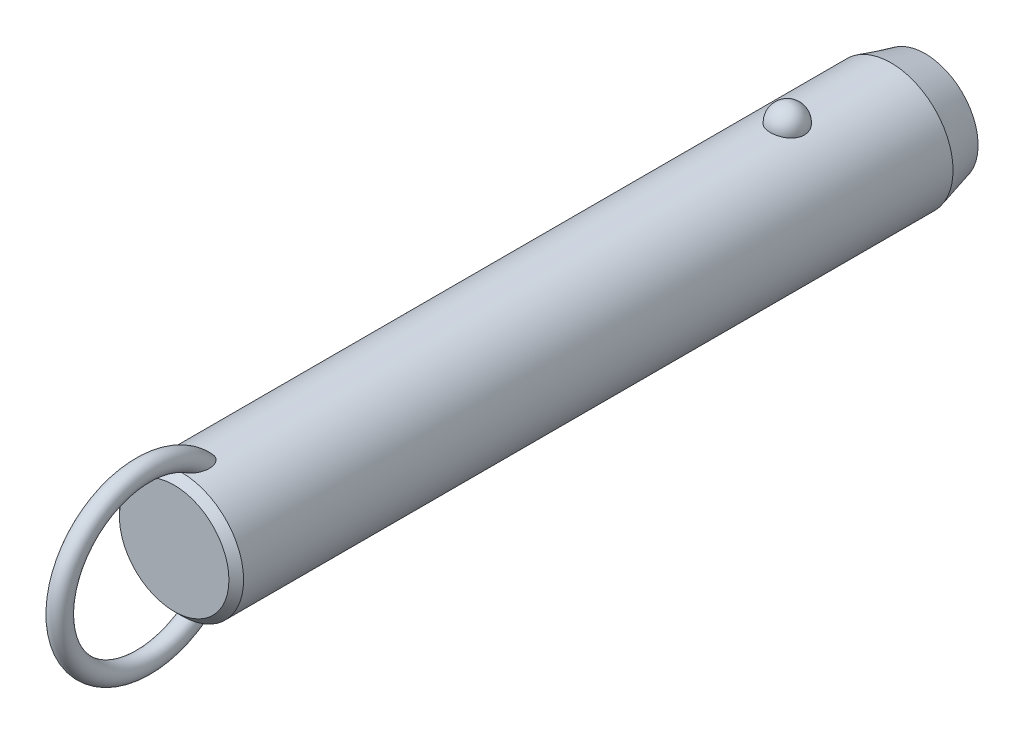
ISO-10303-21;
HEADER;
FILE_DESCRIPTION(('STEP AP214'),'2;1');
FILE_NAME('part.step','',(''),(''),'','','');
FILE_SCHEMA(('AUTOMOTIVE_DESIGN { 1 0 10303 214 1 1 1 1 }'));
ENDSEC;
DATA;
#1=APPLICATION_CONTEXT('core data for automotive mechanical design processes');
#2=APPLICATION_PROTOCOL_DEFINITION('international standard','automotive_design',2000,#1);
#3=PRODUCT_CONTEXT('',#1,'mechanical');
#4=PRODUCT('Part','Part','',(#3));
#5=PRODUCT_RELATED_PRODUCT_CATEGORY('part','',(#4));
#6=PRODUCT_DEFINITION_FORMATION('','',#4);
#7=PRODUCT_DEFINITION_CONTEXT('part definition',#1,'design');
#8=PRODUCT_DEFINITION('design','',#6,#7);
#9=PRODUCT_DEFINITION_SHAPE('','',#8);
#10=(LENGTH_UNIT() NAMED_UNIT(*) SI_UNIT(.MILLI.,.METRE.));
#11=(NAMED_UNIT(*) PLANE_ANGLE_UNIT() SI_UNIT($,.RADIAN.));
#12=(NAMED_UNIT(*) SI_UNIT($,.STERADIAN.) SOLID_ANGLE_UNIT());
#13=UNCERTAINTY_MEASURE_WITH_UNIT(LENGTH_MEASURE(1.E-05),#10,'distance_accuracy_value','');
#14=(GEOMETRIC_REPRESENTATION_CONTEXT(3) GLOBAL_UNCERTAINTY_ASSIGNED_CONTEXT((#13)) GLOBAL_UNIT_ASSIGNED_CONTEXT((#10,
#11,#12)) REPRESENTATION_CONTEXT('',''));
#15=CARTESIAN_POINT('',(0.,0.,0.));
#16=DIRECTION('',(0.,0.,1.));
#17=DIRECTION('',(1.,0.,0.));
#18=AXIS2_PLACEMENT_3D('',#15,#16,#17);
#19=CARTESIAN_POINT('',(0.,0.,109.2));
#20=DIRECTION('',(0.,0.,-1.));
#21=DIRECTION('',(-1.,0.,0.));
#22=AXIS2_PLACEMENT_3D('',#19,#20,#21);
#23=CYLINDRICAL_SURFACE('',#22,12.7);
#24=CARTESIAN_POINT('',(3.46661256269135,12.2177165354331,-3.5));
#25=CARTESIAN_POINT('',(3.4666090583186,12.2177194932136,-3.30432790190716));
#26=CARTESIAN_POINT('',(3.45063567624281,12.2222841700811,-3.10861112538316));
#27=CARTESIAN_POINT('',(3.38712451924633,12.2400345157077,-2.72271899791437));
#28=CARTESIAN_POINT('',(3.33957415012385,12.2532236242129,-2.53254588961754));
#29=CARTESIAN_POINT('',(3.2141234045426,12.286724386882,-2.16324948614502));
#30=CARTESIAN_POINT('',(3.13623639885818,12.3070329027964,-1.98412136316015));
#31=CARTESIAN_POINT('',(2.95205930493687,12.3525018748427,-1.64180592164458));
#32=CARTESIAN_POINT('',(2.84577003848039,12.3776621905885,-1.47861814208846));
#33=CARTESIAN_POINT('',(2.60688050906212,12.4301712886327,-1.17190583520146));
#34=CARTESIAN_POINT('',(2.47415697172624,12.4575299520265,-1.02847897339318));
#35=CARTESIAN_POINT('',(2.18615174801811,12.5112810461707,-0.766177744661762));
#36=CARTESIAN_POINT('',(2.03087002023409,12.5376734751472,-0.64730342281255));
#37=CARTESIAN_POINT('',(1.70237334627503,12.5864761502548,-0.437732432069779));
#38=CARTESIAN_POINT('',(1.52920948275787,12.6088972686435,-0.346958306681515));
#39=CARTESIAN_POINT('',(1.16944170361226,12.6473352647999,-0.195750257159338));
#40=CARTESIAN_POINT('',(0.982839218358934,12.663352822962,-0.135313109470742));
#41=CARTESIAN_POINT('',(0.604961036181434,12.6869706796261,-0.0473241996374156));
#42=CARTESIAN_POINT('',(0.41382314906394,12.6947125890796,-0.0192185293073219));
#43=CARTESIAN_POINT('',(0.0293827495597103,12.7014203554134,0.0051725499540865));
#44=CARTESIAN_POINT('',(-0.163919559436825,12.7003870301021,0.00146092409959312));
#45=CARTESIAN_POINT('',(-0.544374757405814,12.689735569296,-0.0373939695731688));
#46=CARTESIAN_POINT('',(-0.731575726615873,12.6802364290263,-0.0721015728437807));
#47=CARTESIAN_POINT('',(-1.09733277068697,12.6538333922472,-0.171364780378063));
#48=CARTESIAN_POINT('',(-1.27588869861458,12.6369293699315,-0.235920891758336));
#49=CARTESIAN_POINT('',(-1.6204698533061,12.5973946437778,-0.393548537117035));
#50=CARTESIAN_POINT('',(-1.78641865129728,12.5747321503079,-0.486778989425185));
#51=CARTESIAN_POINT('',(-2.10030671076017,12.5261316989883,-0.699110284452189));
#52=CARTESIAN_POINT('',(-2.24824419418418,12.5001934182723,-0.818213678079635));
#53=CARTESIAN_POINT('',(-2.52491489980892,12.4472906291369,-1.08157124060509));
#54=CARTESIAN_POINT('',(-2.65324222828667,12.4203160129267,-1.22624992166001));
#55=CARTESIAN_POINT('',(-2.88410007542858,12.3687509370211,-1.53528325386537));
#56=CARTESIAN_POINT('',(-2.98662883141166,12.3441606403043,-1.69963924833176));
#57=CARTESIAN_POINT('',(-3.16432417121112,12.2998199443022,-2.04548497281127));
#58=CARTESIAN_POINT('',(-3.23917525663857,12.2801261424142,-2.22714424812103));
#59=CARTESIAN_POINT('',(-3.35800573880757,12.248167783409,-2.6009138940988));
#60=CARTESIAN_POINT('',(-3.4019860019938,12.2359030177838,-2.79302397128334));
#61=CARTESIAN_POINT('',(-3.45784812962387,12.2202347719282,-3.18140279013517));
#62=CARTESIAN_POINT('',(-3.46986123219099,12.2167950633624,-3.37765118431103));
#63=CARTESIAN_POINT('',(-3.46186273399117,12.2190638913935,-3.76943689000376));
#64=CARTESIAN_POINT('',(-3.44185196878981,12.2247721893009,-3.96497421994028));
#65=CARTESIAN_POINT('',(-3.37048652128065,12.2446381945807,-4.34881728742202));
#66=CARTESIAN_POINT('',(-3.31928253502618,12.2587552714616,-4.53715319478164));
#67=CARTESIAN_POINT('',(-3.18693461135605,12.2938237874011,-4.90231727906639));
#68=CARTESIAN_POINT('',(-3.1057895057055,12.3147754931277,-5.07914500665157));
#69=CARTESIAN_POINT('',(-2.91506431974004,12.3613125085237,-5.41732059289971));
#70=CARTESIAN_POINT('',(-2.80533587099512,12.3869217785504,-5.57858147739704));
#71=CARTESIAN_POINT('',(-2.560414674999,12.4398525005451,-5.88013283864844));
#72=CARTESIAN_POINT('',(-2.42522099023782,12.4671740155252,-6.02042254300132));
#73=CARTESIAN_POINT('',(-2.1323357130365,12.5205965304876,-6.27662798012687));
#74=CARTESIAN_POINT('',(-1.97456596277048,12.5466928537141,-6.3924554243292));
#75=CARTESIAN_POINT('',(-1.64115839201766,12.5946384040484,-6.59583547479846));
#76=CARTESIAN_POINT('',(-1.46552179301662,12.6164879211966,-6.68339001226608));
#77=CARTESIAN_POINT('',(-1.10356050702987,12.6532533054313,-6.82682153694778));
#78=CARTESIAN_POINT('',(-0.9173913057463,12.6682500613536,-6.8830698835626));
#79=CARTESIAN_POINT('',(-0.537836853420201,12.6900288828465,-6.96386887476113));
#80=CARTESIAN_POINT('',(-0.344452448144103,12.6968119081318,-6.9884232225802));
#81=CARTESIAN_POINT('',(0.0402577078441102,12.7013667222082,-7.00496469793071));
#82=CARTESIAN_POINT('',(0.231556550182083,12.6993008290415,-6.99753844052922));
#83=CARTESIAN_POINT('',(0.610105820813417,12.6867505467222,-6.9516636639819));
#84=CARTESIAN_POINT('',(0.797356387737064,12.6762664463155,-6.913216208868));
#85=CARTESIAN_POINT('',(1.16186657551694,12.6480587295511,-6.80658431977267));
#86=CARTESIAN_POINT('',(1.33915951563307,12.6303611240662,-6.73850666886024));
#87=CARTESIAN_POINT('',(1.67968518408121,12.5896027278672,-6.5745087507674));
#88=CARTESIAN_POINT('',(1.84291705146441,12.5665416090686,-6.47858678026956));
#89=CARTESIAN_POINT('',(2.15340192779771,12.5171072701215,-6.25982455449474));
#90=CARTESIAN_POINT('',(2.30037831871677,12.4906895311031,-6.13660186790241));
#91=CARTESIAN_POINT('',(2.5717412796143,12.4376567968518,-5.86739587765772));
#92=CARTESIAN_POINT('',(2.69612388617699,12.4110417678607,-5.72140858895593));
#93=CARTESIAN_POINT('',(2.92107785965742,12.360051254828,-5.40794137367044));
#94=CARTESIAN_POINT('',(3.02121329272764,12.3357209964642,-5.24014110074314));
#95=CARTESIAN_POINT('',(3.19236291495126,12.2925446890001,-4.88969865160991));
#96=CARTESIAN_POINT('',(3.26338839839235,12.2736965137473,-4.70706226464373));
#97=CARTESIAN_POINT('',(3.36788038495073,12.245404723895,-4.35469510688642));
#98=CARTESIAN_POINT('',(3.40484026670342,12.2351018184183,-4.18605935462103));
#99=CARTESIAN_POINT('',(3.45420764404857,12.2212564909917,-3.84496058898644));
#100=CARTESIAN_POINT('',(3.46661565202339,12.2177139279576,-3.67249765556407));
#101=CARTESIAN_POINT('',(3.46661256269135,12.2177165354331,-3.5));
#102=B_SPLINE_CURVE_WITH_KNOTS('',3,(#24,#25,#26,#27,#28,#29,#30,#31,#32,#33,#34,#35,#36,#37,
#38,#39,#40,#41,#42,#43,#44,#45,#46,#47,#48,#49,#50,#51,#52,#53,#54,#55,#56,#57,#58,#59,#60,#61,
#62,#63,#64,#65,#66,#67,#68,#69,#70,#71,#72,#73,#74,#75,#76,#77,#78,#79,#80,#81,#82,#83,#84,#85,
#86,#87,#88,#89,#90,#91,#92,#93,#94,#95,#96,#97,#98,#99,#100,#101),.UNSPECIFIED.,.T.,.F.,(4,2,2,
2,2,2,2,2,2,2,2,2,2,2,2,2,2,2,2,2,2,2,2,2,2,2,2,2,2,2,2,2,2,2,2,2,2,2,4),(0.,0.586396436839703,
1.17302689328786,1.7593990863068,2.34575431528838,2.93491084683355,3.52406845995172,
4.11158733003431,4.69904375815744,5.2762784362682,5.85345931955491,6.42265312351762,
6.99185659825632,7.56427334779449,8.136746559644,8.71981013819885,9.3029135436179,
9.89247258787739,10.4820150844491,11.0691335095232,11.6562366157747,12.2405256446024,
12.8248374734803,13.412244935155,13.9996740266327,14.5891883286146,15.1786623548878,
15.7609861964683,16.3432419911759,16.9148635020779,17.4864654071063,18.0560241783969,
18.6256177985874,19.2037609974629,19.7820055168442,20.3699810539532,20.957728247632,
21.4746855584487,21.9916320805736),.UNSPECIFIED.);
#103=CARTESIAN_POINT('',(3.46661256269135,12.2177165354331,-3.5));
#104=VERTEX_POINT('',#103);
#105=EDGE_CURVE('E41',#104,#104,#102,.T.);
#106=ORIENTED_EDGE('',*,*,#105,.T.);
#107=EDGE_LOOP('',(#106));
#108=FACE_BOUND('',#107,.T.);
#109=CARTESIAN_POINT('',(0.,0.,120.4));
#110=DIRECTION('',(0.,0.,1.));
#111=DIRECTION('',(1.,0.,0.));
#112=AXIS2_PLACEMENT_3D('',#109,#110,#111);
#113=CIRCLE('',#112,12.7);
#114=CARTESIAN_POINT('',(12.7,0.,120.4));
#115=VERTEX_POINT('',#114);
#116=EDGE_CURVE('E10',#115,#115,#113,.F.);
#117=ORIENTED_EDGE('',*,*,#116,.T.);
#118=EDGE_LOOP('',(#117));
#119=FACE_BOUND('',#118,.T.);
#120=CARTESIAN_POINT('',(-0.548122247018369,-12.6881662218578,114.143218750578));
#121=CARTESIAN_POINT('',(-0.648865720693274,-12.6838128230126,114.177926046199));
#122=CARTESIAN_POINT('',(-0.746398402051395,-12.6783867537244,114.222042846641));
#123=CARTESIAN_POINT('',(-0.932125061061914,-12.666091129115,114.326764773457));
#124=CARTESIAN_POINT('',(-1.02030388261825,-12.6592192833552,114.387396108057));
#125=CARTESIAN_POINT('',(-1.18487740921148,-12.6448747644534,114.521847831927));
#126=CARTESIAN_POINT('',(-1.26134296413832,-12.637406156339,114.595582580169));
#127=CARTESIAN_POINT('',(-1.40231200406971,-12.6225412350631,114.753604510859));
#128=CARTESIAN_POINT('',(-1.46681470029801,-12.6151449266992,114.83789238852));
#129=CARTESIAN_POINT('',(-1.60714786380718,-12.5981718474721,115.049657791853));
#130=CARTESIAN_POINT('',(-1.67725126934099,-12.588900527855,115.180962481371));
#131=CARTESIAN_POINT('',(-1.79536591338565,-12.5725964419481,115.453247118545));
#132=CARTESIAN_POINT('',(-1.84333535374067,-12.5655679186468,115.594244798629));
#133=CARTESIAN_POINT('',(-1.93422576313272,-12.5519624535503,115.937645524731));
#134=CARTESIAN_POINT('',(-1.96788773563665,-12.5466298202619,116.142557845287));
#135=CARTESIAN_POINT('',(-1.9941399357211,-12.542463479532,116.451760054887));
#136=CARTESIAN_POINT('',(-1.99883864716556,-12.5417153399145,116.555298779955));
#137=CARTESIAN_POINT('',(-2.00078003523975,-12.5414074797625,116.76245124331));
#138=CARTESIAN_POINT('',(-1.99802449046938,-12.5418474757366,116.866064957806));
#139=CARTESIAN_POINT('',(-1.98336733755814,-12.5441750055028,117.110320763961));
#140=CARTESIAN_POINT('',(-1.96851430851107,-12.5465291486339,117.250780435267));
#141=CARTESIAN_POINT('',(-1.92707089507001,-12.5529612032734,117.529960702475));
#142=CARTESIAN_POINT('',(-1.90047458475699,-12.5570399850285,117.668680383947));
#143=CARTESIAN_POINT('',(-1.8361912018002,-12.5666008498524,117.94341135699));
#144=CARTESIAN_POINT('',(-1.79850828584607,-12.57208240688,118.079423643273));
#145=CARTESIAN_POINT('',(-1.71223796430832,-12.5841228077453,118.347842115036));
#146=CARTESIAN_POINT('',(-1.66365679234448,-12.5906810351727,118.480250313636));
#147=CARTESIAN_POINT('',(-1.5780450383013,-12.6016176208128,118.68548877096));
#148=CARTESIAN_POINT('',(-1.54477252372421,-12.6057501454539,118.759914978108));
#149=CARTESIAN_POINT('',(-1.47424480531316,-12.6141930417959,118.906839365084));
#150=CARTESIAN_POINT('',(-1.43699041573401,-12.6185033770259,118.979337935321));
#151=CARTESIAN_POINT('',(-1.35825795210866,-12.6272207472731,119.121892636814));
#152=CARTESIAN_POINT('',(-1.31678520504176,-12.6316276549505,119.191951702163));
#153=CARTESIAN_POINT('',(-1.22917793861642,-12.6404532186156,119.329070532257));
#154=CARTESIAN_POINT('',(-1.18304514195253,-12.6448718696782,119.396131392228));
#155=CARTESIAN_POINT('',(-1.07246411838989,-12.6547893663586,119.543874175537));
#156=CARTESIAN_POINT('',(-1.00642239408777,-12.6602600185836,119.623384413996));
#157=CARTESIAN_POINT('',(-0.864441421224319,-12.6707460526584,119.773169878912));
#158=CARTESIAN_POINT('',(-0.788516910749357,-12.6757620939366,119.843458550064));
#159=CARTESIAN_POINT('',(-0.652215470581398,-12.6833591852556,119.948680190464));
#160=CARTESIAN_POINT('',(-0.59498203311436,-12.6861973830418,119.987624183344));
#161=CARTESIAN_POINT('',(-0.475269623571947,-12.6912445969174,120.056489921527));
#162=CARTESIAN_POINT('',(-0.412800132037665,-12.6934547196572,120.086427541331));
#163=CARTESIAN_POINT('',(-0.295749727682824,-12.6966636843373,120.129756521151));
#164=CARTESIAN_POINT('',(-0.241949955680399,-12.6978134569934,120.145218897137));
#165=CARTESIAN_POINT('',(-0.132508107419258,-12.6994261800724,120.166884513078));
#166=CARTESIAN_POINT('',(-0.0768679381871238,-12.6998898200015,120.173097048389));
#167=CARTESIAN_POINT('',(0.0347696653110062,-12.7000752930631,120.175583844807));
#168=CARTESIAN_POINT('',(0.0907676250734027,-12.6997954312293,120.171835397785));
#169=CARTESIAN_POINT('',(0.201283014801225,-12.6985255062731,120.154788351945));
#170=CARTESIAN_POINT('',(0.255799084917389,-12.6975348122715,120.141481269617));
#171=CARTESIAN_POINT('',(0.37604233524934,-12.6946091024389,120.10203792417));
#172=CARTESIAN_POINT('',(0.4409508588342,-12.6924943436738,120.073449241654));
#173=CARTESIAN_POINT('',(0.565350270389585,-12.6875639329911,120.006323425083));
#174=CARTESIAN_POINT('',(0.624828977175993,-12.6847467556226,119.967764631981));
#175=CARTESIAN_POINT('',(0.774116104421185,-12.6767252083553,119.856949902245));
#176=CARTESIAN_POINT('',(0.859449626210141,-12.6711344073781,119.778760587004));
#177=CARTESIAN_POINT('',(1.01789440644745,-12.6593922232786,119.610943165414));
#178=CARTESIAN_POINT('',(1.09096902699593,-12.653239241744,119.521282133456));
#179=CARTESIAN_POINT('',(1.22268793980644,-12.6411674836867,119.340265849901));
#180=CARTESIAN_POINT('',(1.28193986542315,-12.6352572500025,119.249345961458));
#181=CARTESIAN_POINT('',(1.39259777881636,-12.6235401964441,119.062792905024));
#182=CARTESIAN_POINT('',(1.44399707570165,-12.6177334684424,118.967155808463));
#183=CARTESIAN_POINT('',(1.53972870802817,-12.6064093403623,118.772273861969));
#184=CARTESIAN_POINT('',(1.58405262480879,-12.6008922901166,118.673024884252));
#185=CARTESIAN_POINT('',(1.66600705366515,-12.5903187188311,118.471772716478));
#186=CARTESIAN_POINT('',(1.70363651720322,-12.5852622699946,118.369769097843));
#187=CARTESIAN_POINT('',(1.7754537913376,-12.5753406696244,118.154358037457));
#188=CARTESIAN_POINT('',(1.80903453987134,-12.5705328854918,118.040745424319));
#189=CARTESIAN_POINT('',(1.86844163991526,-12.5618400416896,117.811457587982));
#190=CARTESIAN_POINT('',(1.89426665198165,-12.5579551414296,117.695782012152));
#191=CARTESIAN_POINT('',(1.93785464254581,-12.5513030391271,117.463007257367));
#192=CARTESIAN_POINT('',(1.95562640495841,-12.5485346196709,117.345909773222));
#193=CARTESIAN_POINT('',(1.98264463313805,-12.5442934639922,117.110747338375));
#194=CARTESIAN_POINT('',(1.99189298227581,-12.5428204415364,116.99268260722));
#195=CARTESIAN_POINT('',(2.00416068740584,-12.540871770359,116.680622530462));
#196=CARTESIAN_POINT('',(1.99944433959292,-12.541631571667,116.486229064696));
#197=CARTESIAN_POINT('',(1.9611375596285,-12.5476846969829,116.100309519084));
#198=CARTESIAN_POINT('',(1.92758341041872,-12.5529723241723,115.908780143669));
#199=CARTESIAN_POINT('',(1.83934342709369,-12.5661532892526,115.582272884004));
#200=CARTESIAN_POINT('',(1.79215440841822,-12.5730485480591,115.44524997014));
#201=CARTESIAN_POINT('',(1.67676242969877,-12.588958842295,115.180445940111));
#202=CARTESIAN_POINT('',(1.60859050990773,-12.597970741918,115.052651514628));
#203=CARTESIAN_POINT('',(1.4658383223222,-12.6152829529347,114.835800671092));
#204=CARTESIAN_POINT('',(1.39525727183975,-12.6233659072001,114.74410500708));
#205=CARTESIAN_POINT('',(1.23992594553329,-12.6395676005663,114.573485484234));
#206=CARTESIAN_POINT('',(1.15517932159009,-12.6476863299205,114.494558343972));
#207=CARTESIAN_POINT('',(0.971995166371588,-12.6630846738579,114.352643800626));
#208=CARTESIAN_POINT('',(0.873456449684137,-12.6703572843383,114.289784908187));
#209=CARTESIAN_POINT('',(0.665847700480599,-12.6829569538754,114.184487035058));
#210=CARTESIAN_POINT('',(0.556784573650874,-12.688285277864,114.142034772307));
#211=CARTESIAN_POINT('',(0.3473384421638,-12.6956226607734,114.084443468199));
#212=CARTESIAN_POINT('',(0.24775974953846,-12.6979816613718,114.066399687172));
#213=CARTESIAN_POINT('',(0.0470218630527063,-12.7003077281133,114.048600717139));
#214=CARTESIAN_POINT('',(-0.0541350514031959,-12.7002779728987,114.048821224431));
#215=CARTESIAN_POINT('',(-0.221414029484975,-12.6982482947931,114.064363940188));
#216=CARTESIAN_POINT('',(-0.288055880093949,-12.6969033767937,114.074666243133));
#217=CARTESIAN_POINT('',(-0.419599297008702,-12.6932369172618,114.10313489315));
#218=CARTESIAN_POINT('',(-0.484501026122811,-12.6909154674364,114.121300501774));
#219=CARTESIAN_POINT('',(-0.548122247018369,-12.6881662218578,114.143218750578));
#220=B_SPLINE_CURVE_WITH_KNOTS('',3,(#120,#121,#122,#123,#124,#125,#126,#127,#128,#129,#130,
#131,#132,#133,#134,#135,#136,#137,#138,#139,#140,#141,#142,#143,#144,#145,#146,#147,#148,#149,
#150,#151,#152,#153,#154,#155,#156,#157,#158,#159,#160,#161,#162,#163,#164,#165,#166,#167,#168,
#169,#170,#171,#172,#173,#174,#175,#176,#177,#178,#179,#180,#181,#182,#183,#184,#185,#186,#187,
#188,#189,#190,#191,#192,#193,#194,#195,#196,#197,#198,#199,#200,#201,#202,#203,#204,#205,#206,
#207,#208,#209,#210,#211,#212,#213,#214,#215,#216,#217,#218,#219),.UNSPECIFIED.,.T.,.F.,(4,2,2,
2,2,2,2,2,2,2,2,2,2,2,2,2,2,2,2,2,2,2,2,2,2,2,2,2,2,2,2,2,2,2,2,2,2,2,2,2,2,2,2,2,2,2,2,2,2,4),
(0.,0.319642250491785,0.639794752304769,0.957927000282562,1.27608021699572,1.72100165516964,
2.16675988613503,2.78630021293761,3.09705782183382,3.40774128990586,3.83096358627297,
4.25439969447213,4.67767724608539,5.10071330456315,5.34550297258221,5.5902426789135,
5.83467707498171,6.07902143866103,6.38891080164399,6.69834321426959,6.90560910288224,
7.11250749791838,7.279773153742,7.44687060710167,7.61434932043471,7.78197685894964,
7.99365544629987,8.20579780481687,8.55147335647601,8.89816429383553,9.22375138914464,
9.54961437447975,9.87586224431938,10.202161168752,10.5575872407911,10.9130746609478,
11.2681734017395,11.6231936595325,12.2046601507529,12.7853961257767,13.219164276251,
13.6522938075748,13.9989174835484,14.3454519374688,14.6946768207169,15.0436740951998,
15.3457513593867,15.647426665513,15.8493051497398,16.0511646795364),.UNSPECIFIED.);
#221=CARTESIAN_POINT('',(-0.548122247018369,-12.6881662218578,114.143218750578));
#222=VERTEX_POINT('',#221);
#223=EDGE_CURVE('E59',#222,#222,#220,.T.);
#224=ORIENTED_EDGE('',*,*,#223,.T.);
#225=EDGE_LOOP('',(#224));
#226=FACE_BOUND('',#225,.T.);
#227=CARTESIAN_POINT('',(-0.548122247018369,12.6881662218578,114.143218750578));
#228=CARTESIAN_POINT('',(-0.459436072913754,12.6919968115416,114.112673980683));
#229=CARTESIAN_POINT('',(-0.368189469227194,12.6949996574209,114.089391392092));
#230=CARTESIAN_POINT('',(-0.183024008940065,12.6990186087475,114.058406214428));
#231=CARTESIAN_POINT('',(-0.089104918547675,12.7000345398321,114.050704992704));
#232=CARTESIAN_POINT('',(0.0987147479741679,12.6999636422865,114.051245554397));
#233=CARTESIAN_POINT('',(0.192615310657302,12.6988761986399,114.059492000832));
#234=CARTESIAN_POINT('',(0.377658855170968,12.6947211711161,114.091551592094));
#235=CARTESIAN_POINT('',(0.46880177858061,12.6916535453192,114.115365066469));
#236=CARTESIAN_POINT('',(0.645809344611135,12.6838788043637,114.17745651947));
#237=CARTESIAN_POINT('',(0.731679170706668,12.6791733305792,114.215720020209));
#238=CARTESIAN_POINT('',(0.896315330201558,12.6686004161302,114.305120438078));
#239=CARTESIAN_POINT('',(0.975080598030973,12.6627328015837,114.356259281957));
#240=CARTESIAN_POINT('',(1.12963655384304,12.6499161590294,114.47367820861));
#241=CARTESIAN_POINT('',(1.20478673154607,12.6429194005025,114.540792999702));
#242=CARTESIAN_POINT('',(1.34448241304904,12.6288282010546,114.68522507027));
#243=CARTESIAN_POINT('',(1.40902173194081,12.621733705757,114.762548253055));
#244=CARTESIAN_POINT('',(1.55208211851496,12.6050877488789,114.959247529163));
#245=CARTESIAN_POINT('',(1.62510490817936,12.5957546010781,115.082654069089));
#246=CARTESIAN_POINT('',(1.75019044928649,12.5789823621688,115.339769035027));
#247=CARTESIAN_POINT('',(1.80221377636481,12.5715468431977,115.473496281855));
#248=CARTESIAN_POINT('',(1.90309965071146,12.5567434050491,115.798351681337));
#249=CARTESIAN_POINT('',(1.94342317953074,12.5504515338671,115.992161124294));
#250=CARTESIAN_POINT('',(1.99332997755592,12.5426147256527,116.38378810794));
#251=CARTESIAN_POINT('',(2.00285305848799,12.5410790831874,116.581612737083));
#252=CARTESIAN_POINT('',(1.99678999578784,12.5420407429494,116.916642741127));
#253=CARTESIAN_POINT('',(1.98794117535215,12.5434564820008,117.054042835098));
#254=CARTESIAN_POINT('',(1.95865119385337,12.5480641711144,117.327639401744));
#255=CARTESIAN_POINT('',(1.93820436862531,12.5512569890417,117.463835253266));
#256=CARTESIAN_POINT('',(1.88647896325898,12.5591352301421,117.734249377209));
#257=CARTESIAN_POINT('',(1.85518800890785,12.5638223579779,117.86846520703));
#258=CARTESIAN_POINT('',(1.78217886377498,12.5743868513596,118.133936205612));
#259=CARTESIAN_POINT('',(1.74046509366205,12.5802637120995,118.265192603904));
#260=CARTESIAN_POINT('',(1.66024095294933,12.5910571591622,118.486085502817));
#261=CARTESIAN_POINT('',(1.62434772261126,12.5957535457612,118.576690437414));
#262=CARTESIAN_POINT('',(1.54709009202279,12.6054762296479,118.755512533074));
#263=CARTESIAN_POINT('',(1.50572681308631,12.6105024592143,118.843730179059));
#264=CARTESIAN_POINT('',(1.41728020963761,12.620748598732,119.016932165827));
#265=CARTESIAN_POINT('',(1.37021377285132,12.625967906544,119.101925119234));
#266=CARTESIAN_POINT('',(1.26969620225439,12.6364721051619,119.268007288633));
#267=CARTESIAN_POINT('',(1.21624929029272,12.6417569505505,119.349099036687));
#268=CARTESIAN_POINT('',(1.10304413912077,12.6521331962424,119.504702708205));
#269=CARTESIAN_POINT('',(1.04340936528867,12.657226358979,119.579303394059));
#270=CARTESIAN_POINT('',(0.915919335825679,12.6670906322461,119.721324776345));
#271=CARTESIAN_POINT('',(0.848064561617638,12.6718617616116,119.788745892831));
#272=CARTESIAN_POINT('',(0.717035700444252,12.67987711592,119.900624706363));
#273=CARTESIAN_POINT('',(0.655526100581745,12.6832377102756,119.946997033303));
#274=CARTESIAN_POINT('',(0.525985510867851,12.6892676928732,120.029619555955));
#275=CARTESIAN_POINT('',(0.45796984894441,12.6919386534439,120.065892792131));
#276=CARTESIAN_POINT('',(0.334859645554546,12.695691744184,120.116657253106));
#277=CARTESIAN_POINT('',(0.281116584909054,12.6970073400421,120.134373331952));
#278=CARTESIAN_POINT('',(0.171425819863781,12.6989609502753,120.160642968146));
#279=CARTESIAN_POINT('',(0.115480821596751,12.699599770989,120.169207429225));
#280=CARTESIAN_POINT('',(0.00272618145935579,12.7001251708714,120.176253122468));
#281=CARTESIAN_POINT('',(-0.0540859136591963,12.7000089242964,120.174696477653));
#282=CARTESIAN_POINT('',(-0.166544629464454,12.6990328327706,120.161600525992));
#283=CARTESIAN_POINT('',(-0.222190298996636,12.6981724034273,120.150053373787));
#284=CARTESIAN_POINT('',(-0.342018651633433,12.695562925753,120.114912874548));
#285=CARTESIAN_POINT('',(-0.405606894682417,12.6936676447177,120.08933225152));
#286=CARTESIAN_POINT('',(-0.527815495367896,12.6891754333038,120.028311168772));
#287=CARTESIAN_POINT('',(-0.586425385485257,12.6865770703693,119.992850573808));
#288=CARTESIAN_POINT('',(-0.731842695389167,12.6792129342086,119.891496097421));
#289=CARTESIAN_POINT('',(-0.814709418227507,12.6740767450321,119.8200395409));
#290=CARTESIAN_POINT('',(-0.969101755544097,12.6632083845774,119.66589007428));
#291=CARTESIAN_POINT('',(-1.04059564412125,12.6574746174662,119.583166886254));
#292=CARTESIAN_POINT('',(-1.16981116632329,12.6461638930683,119.415809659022));
#293=CARTESIAN_POINT('',(-1.22811369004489,12.6405994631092,119.331616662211));
#294=CARTESIAN_POINT('',(-1.33743405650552,12.6295007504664,119.158579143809));
#295=CARTESIAN_POINT('',(-1.38844577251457,12.6239664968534,119.069730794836));
#296=CARTESIAN_POINT('',(-1.48400702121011,12.6130898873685,118.888389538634));
#297=CARTESIAN_POINT('',(-1.52854232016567,12.6077479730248,118.795889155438));
#298=CARTESIAN_POINT('',(-1.6115011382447,12.5974127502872,118.608160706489));
#299=CARTESIAN_POINT('',(-1.64992317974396,12.5924195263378,118.512931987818));
#300=CARTESIAN_POINT('',(-1.73468589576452,12.581070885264,118.28289362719));
#301=CARTESIAN_POINT('',(-1.77831261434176,12.5749388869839,118.147066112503));
#302=CARTESIAN_POINT('',(-1.85439734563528,12.5639437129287,117.872212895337));
#303=CARTESIAN_POINT('',(-1.88684994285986,12.5590811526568,117.733185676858));
#304=CARTESIAN_POINT('',(-1.94008483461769,12.550968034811,117.45309235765));
#305=CARTESIAN_POINT('',(-1.96088706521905,12.5477147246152,117.312030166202));
#306=CARTESIAN_POINT('',(-1.99000539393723,12.5431291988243,117.028668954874));
#307=CARTESIAN_POINT('',(-1.99832911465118,12.5417958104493,116.886370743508));
#308=CARTESIAN_POINT('',(-2.00166624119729,12.5412674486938,116.557627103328));
#309=CARTESIAN_POINT('',(-1.99178843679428,12.5428579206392,116.371088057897));
#310=CARTESIAN_POINT('',(-1.9445518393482,12.5502731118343,116.00162404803));
#311=CARTESIAN_POINT('',(-1.90724032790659,12.5560905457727,115.818693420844));
#312=CARTESIAN_POINT('',(-1.81330718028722,12.5699462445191,115.504848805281));
#313=CARTESIAN_POINT('',(-1.76338820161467,12.5771273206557,115.371910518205));
#314=CARTESIAN_POINT('',(-1.64305018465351,12.593414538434,115.115681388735));
#315=CARTESIAN_POINT('',(-1.57265346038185,12.6025185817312,114.992380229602));
#316=CARTESIAN_POINT('',(-1.42634956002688,12.6198178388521,114.783564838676));
#317=CARTESIAN_POINT('',(-1.35423772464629,12.6278405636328,114.695384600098));
#318=CARTESIAN_POINT('',(-1.19645664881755,12.6437632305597,114.532107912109));
#319=CARTESIAN_POINT('',(-1.11080536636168,12.6516633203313,114.456994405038));
#320=CARTESIAN_POINT('',(-0.947219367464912,12.6648319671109,114.337811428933));
#321=CARTESIAN_POINT('',(-0.871624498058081,12.670300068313,114.290541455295));
#322=CARTESIAN_POINT('',(-0.714161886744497,12.6801492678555,114.2077413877));
#323=CARTESIAN_POINT('',(-0.632295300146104,12.684530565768,114.17220913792));
#324=CARTESIAN_POINT('',(-0.548122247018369,12.6881662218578,114.143218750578));
#325=B_SPLINE_CURVE_WITH_KNOTS('',3,(#227,#228,#229,#230,#231,#232,#233,#234,#235,#236,#237,
#238,#239,#240,#241,#242,#243,#244,#245,#246,#247,#248,#249,#250,#251,#252,#253,#254,#255,#256,
#257,#258,#259,#260,#261,#262,#263,#264,#265,#266,#267,#268,#269,#270,#271,#272,#273,#274,#275,
#276,#277,#278,#279,#280,#281,#282,#283,#284,#285,#286,#287,#288,#289,#290,#291,#292,#293,#294,
#295,#296,#297,#298,#299,#300,#301,#302,#303,#304,#305,#306,#307,#308,#309,#310,#311,#312,#313,
#314,#315,#316,#317,#318,#319,#320,#321,#322,#323,#324),.UNSPECIFIED.,.T.,.F.,(4,2,2,2,2,2,2,2,
2,2,2,2,2,2,2,2,2,2,2,2,2,2,2,2,2,2,2,2,2,2,2,2,2,2,2,2,2,2,2,2,2,2,2,2,2,2,2,2,4),(0.,
0.281328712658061,0.562682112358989,0.844117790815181,1.12555942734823,1.40671982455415,
1.68792232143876,1.98972294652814,2.2916988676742,2.72039860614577,3.14989948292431,
3.7408491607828,4.33295293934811,4.74554109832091,5.15833092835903,5.57159335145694,
5.98468079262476,6.27722775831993,6.56971484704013,6.86135609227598,7.15280542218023,
7.43927407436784,7.72572595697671,7.95635862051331,8.18646071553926,8.35559393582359,
8.52452541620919,8.69408946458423,8.86378678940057,9.06834348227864,9.27332014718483,
9.60010414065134,9.92778432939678,10.2350252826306,10.5425229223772,10.8506864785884,
11.1589244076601,11.5867893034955,12.0148612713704,12.4421984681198,12.8692745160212,
13.4279365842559,13.9856380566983,14.4107062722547,14.8353130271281,15.1765567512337,
15.5173516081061,15.7844129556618,16.051425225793),.UNSPECIFIED.);
#326=CARTESIAN_POINT('',(-0.548122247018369,12.6881662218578,114.143218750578));
#327=VERTEX_POINT('',#326);
#328=EDGE_CURVE('E66',#327,#327,#325,.T.);
#329=ORIENTED_EDGE('',*,*,#328,.T.);
#330=EDGE_LOOP('',(#329));
#331=FACE_BOUND('',#330,.T.);
#332=CARTESIAN_POINT('',(0.,0.,-24.6999999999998));
#333=DIRECTION('',(0.,0.,-1.));
#334=DIRECTION('',(-1.,0.,0.));
#335=AXIS2_PLACEMENT_3D('',#332,#333,#334);
#336=CIRCLE('',#335,12.7);
#337=CARTESIAN_POINT('',(-12.7,0.,-24.6999999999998));
#338=VERTEX_POINT('',#337);
#339=EDGE_CURVE('E56',#338,#338,#336,.F.);
#340=ORIENTED_EDGE('',*,*,#339,.T.);
#341=EDGE_LOOP('',(#340));
#342=FACE_BOUND('',#341,.T.);
#343=ADVANCED_FACE('F37',(#108,#119,#226,#331,#342),#23,.T.);
#344=CARTESIAN_POINT('',(0.,0.,-31.7));
#345=DIRECTION('',(0.,0.,-1.));
#346=DIRECTION('',(-1.,0.,0.));
#347=AXIS2_PLACEMENT_3D('',#344,#345,#346);
#348=PLANE('',#347);
#349=CARTESIAN_POINT('',(0.,0.,-31.7));
#350=DIRECTION('',(0.,0.,-1.));
#351=DIRECTION('',(-1.,0.,0.));
#352=AXIS2_PLACEMENT_3D('',#349,#350,#351);
#353=CIRCLE('',#352,10.8243556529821);
#354=CARTESIAN_POINT('',(-10.8243556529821,0.,-31.7));
#355=VERTEX_POINT('',#354);
#356=EDGE_CURVE('E65',#355,#355,#353,.T.);
#357=ORIENTED_EDGE('',*,*,#356,.T.);
#358=EDGE_LOOP('',(#357));
#359=FACE_BOUND('',#358,.T.);
#360=ADVANCED_FACE('F84',(#359),#348,.T.);
#361=CARTESIAN_POINT('',(0.,0.,-31.7));
#362=DIRECTION('',(0.,0.,1.));
#363=DIRECTION('',(1.,0.,0.));
#364=AXIS2_PLACEMENT_3D('',#361,#362,#363);
#365=CONICAL_SURFACE('',#364,10.8243556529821,0.261799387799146);
#366=ORIENTED_EDGE('',*,*,#339,.F.);
#367=EDGE_LOOP('',(#366));
#368=FACE_BOUND('',#367,.T.);
#369=ORIENTED_EDGE('',*,*,#356,.F.);
#370=EDGE_LOOP('',(#369));
#371=FACE_BOUND('',#370,.T.);
#372=ADVANCED_FACE('F82',(#368,#371),#365,.T.);
#373=CARTESIAN_POINT('',(0.,0.,121.9));
#374=DIRECTION('',(0.,0.,1.));
#375=DIRECTION('',(1.,0.,0.));
#376=AXIS2_PLACEMENT_3D('',#373,#374,#375);
#377=PLANE('',#376);
#378=CARTESIAN_POINT('',(0.,0.,121.9));
#379=DIRECTION('',(0.,0.,1.));
#380=DIRECTION('',(1.,0.,0.));
#381=AXIS2_PLACEMENT_3D('',#378,#379,#380);
#382=CIRCLE('',#381,11.2);
#383=CARTESIAN_POINT('',(11.2,0.,121.9));
#384=VERTEX_POINT('',#383);
#385=EDGE_CURVE('E50',#384,#384,#382,.T.);
#386=ORIENTED_EDGE('',*,*,#385,.T.);
#387=EDGE_LOOP('',(#386));
#388=FACE_BOUND('',#387,.T.);
#389=ADVANCED_FACE('F76',(#388),#377,.T.);
#390=CARTESIAN_POINT('',(0.,0.,128.25));
#391=DIRECTION('',(1.,0.,0.));
#392=DIRECTION('',(0.,0.,-1.));
#393=AXIS2_PLACEMENT_3D('',#390,#391,#392);
#394=TOROIDAL_SURFACE('',#393,17.05,2.);
#395=ORIENTED_EDGE('',*,*,#328,.F.);
#396=EDGE_LOOP('',(#395));
#397=FACE_BOUND('',#396,.T.);
#398=ORIENTED_EDGE('',*,*,#223,.F.);
#399=EDGE_LOOP('',(#398));
#400=FACE_BOUND('',#399,.T.);
#401=ADVANCED_FACE('F72',(#397,#400),#394,.T.);
#402=CARTESIAN_POINT('',(0.,0.,121.9));
#403=DIRECTION('',(0.,0.,-1.));
#404=DIRECTION('',(-1.,0.,0.));
#405=AXIS2_PLACEMENT_3D('',#402,#403,#404);
#406=CONICAL_SURFACE('',#405,11.2,0.785398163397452);
#407=ORIENTED_EDGE('',*,*,#116,.F.);
#408=EDGE_LOOP('',(#407));
#409=FACE_BOUND('',#408,.T.);
#410=ORIENTED_EDGE('',*,*,#385,.F.);
#411=EDGE_LOOP('',(#410));
#412=FACE_BOUND('',#411,.T.);
#413=ADVANCED_FACE('F39',(#409,#412),#406,.T.);
#414=CARTESIAN_POINT('',(0.,12.7,-3.5));
#415=DIRECTION('',(0.,1.,0.));
#416=DIRECTION('',(0.,0.,-1.));
#417=AXIS2_PLACEMENT_3D('',#414,#415,#416);
#418=SPHERICAL_SURFACE('',#417,3.5);
#419=ORIENTED_EDGE('',*,*,#105,.F.);
#420=EDGE_LOOP('',(#419));
#421=FACE_BOUND('',#420,.T.);
#422=ADVANCED_FACE('F78',(#421),#418,.T.);
#423=CLOSED_SHELL('',(#343,#360,#372,#389,#401,#413,#422));
#424=MANIFOLD_SOLID_BREP('B2',#423);
#425=ADVANCED_BREP_SHAPE_REPRESENTATION('',(#18,#424),#14);
#426=SHAPE_DEFINITION_REPRESENTATION(#9,#425);
ENDSEC;
END-ISO-10303-21;
